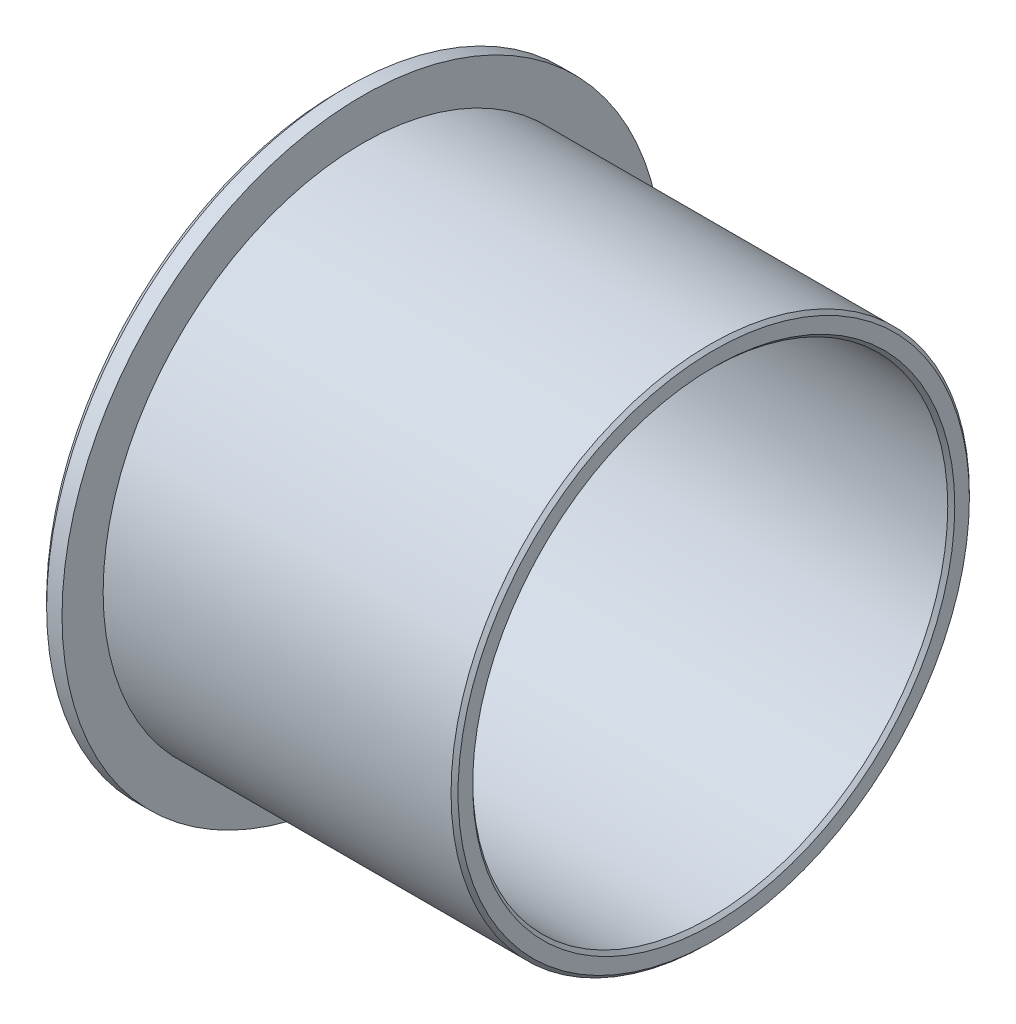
ISO-10303-21;
HEADER;
FILE_DESCRIPTION(('STEP AP214'),'2;1');
FILE_NAME('part.step','',(''),(''),'','','');
FILE_SCHEMA(('AUTOMOTIVE_DESIGN { 1 0 10303 214 1 1 1 1 }'));
ENDSEC;
DATA;
#1=APPLICATION_CONTEXT('core data for automotive mechanical design processes');
#2=APPLICATION_PROTOCOL_DEFINITION('international standard','automotive_design',2000,#1);
#3=PRODUCT_CONTEXT('',#1,'mechanical');
#4=PRODUCT('Part','Part','',(#3));
#5=PRODUCT_RELATED_PRODUCT_CATEGORY('part','',(#4));
#6=PRODUCT_DEFINITION_FORMATION('','',#4);
#7=PRODUCT_DEFINITION_CONTEXT('part definition',#1,'design');
#8=PRODUCT_DEFINITION('design','',#6,#7);
#9=PRODUCT_DEFINITION_SHAPE('','',#8);
#10=(LENGTH_UNIT() NAMED_UNIT(*) SI_UNIT(.MILLI.,.METRE.));
#11=(NAMED_UNIT(*) PLANE_ANGLE_UNIT() SI_UNIT($,.RADIAN.));
#12=(NAMED_UNIT(*) SI_UNIT($,.STERADIAN.) SOLID_ANGLE_UNIT());
#13=UNCERTAINTY_MEASURE_WITH_UNIT(LENGTH_MEASURE(1.E-05),#10,'distance_accuracy_value','');
#14=(GEOMETRIC_REPRESENTATION_CONTEXT(3) GLOBAL_UNCERTAINTY_ASSIGNED_CONTEXT((#13)) GLOBAL_UNIT_ASSIGNED_CONTEXT((#10,
#11,#12)) REPRESENTATION_CONTEXT('',''));
#15=CARTESIAN_POINT('',(0.,0.,0.));
#16=DIRECTION('',(0.,0.,1.));
#17=DIRECTION('',(1.,0.,0.));
#18=AXIS2_PLACEMENT_3D('',#15,#16,#17);
#19=CARTESIAN_POINT('',(0.,0.,0.));
#20=DIRECTION('',(1.,0.,0.));
#21=DIRECTION('',(0.,0.,-1.));
#22=AXIS2_PLACEMENT_3D('',#19,#20,#21);
#23=PLANE('',#22);
#24=CARTESIAN_POINT('',(0.,0.,0.));
#25=DIRECTION('',(1.,0.,0.));
#26=DIRECTION('',(0.,0.,-1.));
#27=AXIS2_PLACEMENT_3D('',#24,#25,#26);
#28=CIRCLE('',#27,27.320875);
#29=CARTESIAN_POINT('',(0.,0.,-27.320875));
#30=VERTEX_POINT('',#29);
#31=EDGE_CURVE('E10',#30,#30,#28,.T.);
#32=ORIENTED_EDGE('',*,*,#31,.T.);
#33=EDGE_LOOP('',(#32));
#34=FACE_BOUND('',#33,.T.);
#35=CARTESIAN_POINT('',(0.,0.,0.));
#36=DIRECTION('',(1.,0.,0.));
#37=DIRECTION('',(0.,0.,-1.));
#38=AXIS2_PLACEMENT_3D('',#35,#36,#37);
#39=CIRCLE('',#38,33.24225);
#40=CARTESIAN_POINT('',(0.,0.,-33.24225));
#41=VERTEX_POINT('',#40);
#42=EDGE_CURVE('E41',#41,#41,#39,.F.);
#43=ORIENTED_EDGE('',*,*,#42,.T.);
#44=EDGE_LOOP('',(#43));
#45=FACE_BOUND('',#44,.T.);
#46=ADVANCED_FACE('F15',(#34,#45),#23,.F.);
#47=CARTESIAN_POINT('',(42.3672,0.,0.));
#48=DIRECTION('',(1.,0.,0.));
#49=DIRECTION('',(0.,0.,-1.));
#50=AXIS2_PLACEMENT_3D('',#47,#48,#49);
#51=PLANE('',#50);
#52=CARTESIAN_POINT('',(42.3672,0.,0.));
#53=DIRECTION('',(1.,0.,0.));
#54=DIRECTION('',(0.,0.,-1.));
#55=AXIS2_PLACEMENT_3D('',#52,#53,#54);
#56=CIRCLE('',#55,27.320875);
#57=CARTESIAN_POINT('',(42.3672,0.,-27.320875));
#58=VERTEX_POINT('',#57);
#59=EDGE_CURVE('E26',#58,#58,#56,.F.);
#60=ORIENTED_EDGE('',*,*,#59,.T.);
#61=EDGE_LOOP('',(#60));
#62=FACE_BOUND('',#61,.T.);
#63=CARTESIAN_POINT('',(42.3672,0.,0.));
#64=DIRECTION('',(1.,0.,0.));
#65=DIRECTION('',(0.,0.,-1.));
#66=AXIS2_PLACEMENT_3D('',#63,#64,#65);
#67=CIRCLE('',#66,28.978225);
#68=CARTESIAN_POINT('',(42.3672,0.,-28.978225));
#69=VERTEX_POINT('',#68);
#70=EDGE_CURVE('E30',#69,#69,#67,.T.);
#71=ORIENTED_EDGE('',*,*,#70,.T.);
#72=EDGE_LOOP('',(#71));
#73=FACE_BOUND('',#72,.T.);
#74=ADVANCED_FACE('F73',(#62,#73),#51,.T.);
#75=CARTESIAN_POINT('',(2.54,0.,0.));
#76=DIRECTION('',(1.,0.,0.));
#77=DIRECTION('',(0.,0.,-1.));
#78=AXIS2_PLACEMENT_3D('',#75,#76,#77);
#79=PLANE('',#78);
#80=CARTESIAN_POINT('',(2.54,0.,0.));
#81=DIRECTION('',(1.,0.,0.));
#82=DIRECTION('',(0.,0.,-1.));
#83=AXIS2_PLACEMENT_3D('',#80,#81,#82);
#84=CIRCLE('',#83,34.036);
#85=CARTESIAN_POINT('',(2.54,0.,-34.036));
#86=VERTEX_POINT('',#85);
#87=EDGE_CURVE('E47',#86,#86,#84,.T.);
#88=ORIENTED_EDGE('',*,*,#87,.T.);
#89=EDGE_LOOP('',(#88));
#90=FACE_BOUND('',#89,.T.);
#91=CARTESIAN_POINT('',(2.54,0.,0.));
#92=DIRECTION('',(1.,0.,0.));
#93=DIRECTION('',(0.,0.,-1.));
#94=AXIS2_PLACEMENT_3D('',#91,#92,#93);
#95=CIRCLE('',#94,29.3751);
#96=CARTESIAN_POINT('',(2.54,0.,-29.3751));
#97=VERTEX_POINT('',#96);
#98=EDGE_CURVE('E50',#97,#97,#95,.F.);
#99=ORIENTED_EDGE('',*,*,#98,.T.);
#100=EDGE_LOOP('',(#99));
#101=FACE_BOUND('',#100,.T.);
#102=ADVANCED_FACE('F54',(#90,#101),#79,.T.);
#103=CARTESIAN_POINT('',(2.54,0.,0.));
#104=DIRECTION('',(-1.,0.,0.));
#105=DIRECTION('',(0.,0.,1.));
#106=AXIS2_PLACEMENT_3D('',#103,#104,#105);
#107=CYLINDRICAL_SURFACE('',#106,34.036);
#108=CARTESIAN_POINT('',(0.793750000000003,0.,0.));
#109=DIRECTION('',(1.,0.,0.));
#110=DIRECTION('',(0.,0.,-1.));
#111=AXIS2_PLACEMENT_3D('',#108,#109,#110);
#112=CIRCLE('',#111,34.036);
#113=CARTESIAN_POINT('',(0.793750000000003,0.,-34.036));
#114=VERTEX_POINT('',#113);
#115=EDGE_CURVE('E44',#114,#114,#112,.T.);
#116=ORIENTED_EDGE('',*,*,#115,.T.);
#117=EDGE_LOOP('',(#116));
#118=FACE_BOUND('',#117,.T.);
#119=ORIENTED_EDGE('',*,*,#87,.F.);
#120=EDGE_LOOP('',(#119));
#121=FACE_BOUND('',#120,.T.);
#122=ADVANCED_FACE('F17',(#118,#121),#107,.T.);
#123=CARTESIAN_POINT('',(42.3672,0.,0.));
#124=DIRECTION('',(-1.,0.,0.));
#125=DIRECTION('',(0.,0.,1.));
#126=AXIS2_PLACEMENT_3D('',#123,#124,#125);
#127=CYLINDRICAL_SURFACE('',#126,29.3751);
#128=CARTESIAN_POINT('',(41.970325,0.,0.));
#129=DIRECTION('',(1.,0.,0.));
#130=DIRECTION('',(0.,0.,-1.));
#131=AXIS2_PLACEMENT_3D('',#128,#129,#130);
#132=CIRCLE('',#131,29.3751);
#133=CARTESIAN_POINT('',(41.970325,0.,-29.3751));
#134=VERTEX_POINT('',#133);
#135=EDGE_CURVE('E22',#134,#134,#132,.F.);
#136=ORIENTED_EDGE('',*,*,#135,.T.);
#137=EDGE_LOOP('',(#136));
#138=FACE_BOUND('',#137,.T.);
#139=ORIENTED_EDGE('',*,*,#98,.F.);
#140=EDGE_LOOP('',(#139));
#141=FACE_BOUND('',#140,.T.);
#142=ADVANCED_FACE('F56',(#138,#141),#127,.T.);
#143=CARTESIAN_POINT('',(42.3672,0.,0.));
#144=DIRECTION('',(-1.,0.,0.));
#145=DIRECTION('',(0.,0.,1.));
#146=AXIS2_PLACEMENT_3D('',#143,#144,#145);
#147=CYLINDRICAL_SURFACE('',#146,26.924);
#148=CARTESIAN_POINT('',(41.970325,0.,0.));
#149=DIRECTION('',(1.,0.,0.));
#150=DIRECTION('',(0.,0.,-1.));
#151=AXIS2_PLACEMENT_3D('',#148,#149,#150);
#152=CIRCLE('',#151,26.924);
#153=CARTESIAN_POINT('',(41.970325,0.,-26.924));
#154=VERTEX_POINT('',#153);
#155=EDGE_CURVE('E35',#154,#154,#152,.T.);
#156=ORIENTED_EDGE('',*,*,#155,.T.);
#157=EDGE_LOOP('',(#156));
#158=FACE_BOUND('',#157,.T.);
#159=CARTESIAN_POINT('',(0.396875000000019,0.,0.));
#160=DIRECTION('',(1.,0.,0.));
#161=DIRECTION('',(0.,0.,-1.));
#162=AXIS2_PLACEMENT_3D('',#159,#160,#161);
#163=CIRCLE('',#162,26.924);
#164=CARTESIAN_POINT('',(0.396875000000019,0.,-26.924));
#165=VERTEX_POINT('',#164);
#166=EDGE_CURVE('E38',#165,#165,#163,.F.);
#167=ORIENTED_EDGE('',*,*,#166,.T.);
#168=EDGE_LOOP('',(#167));
#169=FACE_BOUND('',#168,.T.);
#170=ADVANCED_FACE('F58',(#158,#169),#147,.F.);
#171=CARTESIAN_POINT('',(0.793750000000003,0.,0.));
#172=DIRECTION('',(1.,0.,0.));
#173=DIRECTION('',(0.,0.,-1.));
#174=AXIS2_PLACEMENT_3D('',#171,#172,#173);
#175=CONICAL_SURFACE('',#174,34.036,0.785398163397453);
#176=CARTESIAN_POINT('',(0.,0.,-33.24225));
#177=CARTESIAN_POINT('',(0.00826822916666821,0.,-33.2505182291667));
#178=CARTESIAN_POINT('',(0.0165364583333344,0.,-33.2587864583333));
#179=CARTESIAN_POINT('',(0.0330729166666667,0.,-33.2753229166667));
#180=CARTESIAN_POINT('',(0.0413411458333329,0.,-33.2835911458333));
#181=CARTESIAN_POINT('',(0.0578776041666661,0.,-33.3001276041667));
#182=CARTESIAN_POINT('',(0.0661458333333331,0.,-33.3083958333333));
#183=CARTESIAN_POINT('',(0.0826822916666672,0.,-33.3249322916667));
#184=CARTESIAN_POINT('',(0.0909505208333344,0.,-33.3332005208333));
#185=CARTESIAN_POINT('',(0.107486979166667,0.,-33.3497369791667));
#186=CARTESIAN_POINT('',(0.115755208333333,0.,-33.3580052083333));
#187=CARTESIAN_POINT('',(0.132291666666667,0.,-33.3745416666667));
#188=CARTESIAN_POINT('',(0.140559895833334,0.,-33.3828098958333));
#189=CARTESIAN_POINT('',(0.157096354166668,0.,-33.3993463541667));
#190=CARTESIAN_POINT('',(0.165364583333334,0.,-33.4076145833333));
#191=CARTESIAN_POINT('',(0.181901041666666,0.,-33.4241510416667));
#192=CARTESIAN_POINT('',(0.190169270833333,0.,-33.4324192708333));
#193=CARTESIAN_POINT('',(0.206705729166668,0.,-33.4489557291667));
#194=CARTESIAN_POINT('',(0.214973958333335,0.,-33.4572239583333));
#195=CARTESIAN_POINT('',(0.231510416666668,0.,-33.4737604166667));
#196=CARTESIAN_POINT('',(0.239778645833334,0.,-33.4820286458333));
#197=CARTESIAN_POINT('',(0.256315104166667,0.,-33.4985651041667));
#198=CARTESIAN_POINT('',(0.264583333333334,0.,-33.5068333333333));
#199=CARTESIAN_POINT('',(0.281119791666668,0.,-33.5233697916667));
#200=CARTESIAN_POINT('',(0.289388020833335,0.,-33.5316380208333));
#201=CARTESIAN_POINT('',(0.305924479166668,0.,-33.5481744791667));
#202=CARTESIAN_POINT('',(0.314192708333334,0.,-33.5564427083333));
#203=CARTESIAN_POINT('',(0.330729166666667,0.,-33.5729791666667));
#204=CARTESIAN_POINT('',(0.338997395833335,0.,-33.5812473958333));
#205=CARTESIAN_POINT('',(0.355533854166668,0.,-33.5977838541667));
#206=CARTESIAN_POINT('',(0.363802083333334,0.,-33.6060520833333));
#207=CARTESIAN_POINT('',(0.380338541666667,0.,-33.6225885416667));
#208=CARTESIAN_POINT('',(0.388606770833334,0.,-33.6308567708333));
#209=CARTESIAN_POINT('',(0.405143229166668,0.,-33.6473932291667));
#210=CARTESIAN_POINT('',(0.413411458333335,0.,-33.6556614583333));
#211=CARTESIAN_POINT('',(0.429947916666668,0.,-33.6721979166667));
#212=CARTESIAN_POINT('',(0.438216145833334,0.,-33.6804661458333));
#213=CARTESIAN_POINT('',(0.454752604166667,0.,-33.6970026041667));
#214=CARTESIAN_POINT('',(0.463020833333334,0.,-33.7052708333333));
#215=CARTESIAN_POINT('',(0.479557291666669,0.,-33.7218072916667));
#216=CARTESIAN_POINT('',(0.487825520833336,0.,-33.7300755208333));
#217=CARTESIAN_POINT('',(0.504361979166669,0.,-33.7466119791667));
#218=CARTESIAN_POINT('',(0.512630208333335,0.,-33.7548802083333));
#219=CARTESIAN_POINT('',(0.529166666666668,0.,-33.7714166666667));
#220=CARTESIAN_POINT('',(0.537434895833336,0.,-33.7796848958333));
#221=CARTESIAN_POINT('',(0.553971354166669,0.,-33.7962213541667));
#222=CARTESIAN_POINT('',(0.562239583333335,0.,-33.8044895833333));
#223=CARTESIAN_POINT('',(0.578776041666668,0.,-33.8210260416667));
#224=CARTESIAN_POINT('',(0.587044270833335,0.,-33.8292942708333));
#225=CARTESIAN_POINT('',(0.603580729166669,0.,-33.8458307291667));
#226=CARTESIAN_POINT('',(0.611848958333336,0.,-33.8540989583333));
#227=CARTESIAN_POINT('',(0.628385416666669,0.,-33.8706354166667));
#228=CARTESIAN_POINT('',(0.636653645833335,0.,-33.8789036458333));
#229=CARTESIAN_POINT('',(0.653190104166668,0.,-33.8954401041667));
#230=CARTESIAN_POINT('',(0.661458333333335,0.,-33.9037083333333));
#231=CARTESIAN_POINT('',(0.677994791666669,0.,-33.9202447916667));
#232=CARTESIAN_POINT('',(0.686263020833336,0.,-33.9285130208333));
#233=CARTESIAN_POINT('',(0.702799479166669,0.,-33.9450494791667));
#234=CARTESIAN_POINT('',(0.711067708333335,0.,-33.9533177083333));
#235=CARTESIAN_POINT('',(0.727604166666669,0.,-33.9698541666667));
#236=CARTESIAN_POINT('',(0.735872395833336,0.,-33.9781223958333));
#237=CARTESIAN_POINT('',(0.75240885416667,0.,-33.9946588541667));
#238=CARTESIAN_POINT('',(0.760677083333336,0.,-34.0029270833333));
#239=CARTESIAN_POINT('',(0.777213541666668,0.,-34.0194635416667));
#240=CARTESIAN_POINT('',(0.785481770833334,0.,-34.0277317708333));
#241=CARTESIAN_POINT('',(0.793750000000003,0.,-34.036));
#242=B_SPLINE_CURVE_WITH_KNOTS('',3,(#176,#177,#178,#179,#180,#181,#182,#183,#184,#185,#186,
#187,#188,#189,#190,#191,#192,#193,#194,#195,#196,#197,#198,#199,#200,#201,#202,#203,#204,#205,
#206,#207,#208,#209,#210,#211,#212,#213,#214,#215,#216,#217,#218,#219,#220,#221,#222,#223,#224,
#225,#226,#227,#228,#229,#230,#231,#232,#233,#234,#235,#236,#237,#238,#239,#240,#241),
.UNSPECIFIED.,.F.,.F.,(4,2,2,2,2,2,2,2,2,2,2,2,2,2,2,2,2,2,2,2,2,2,2,2,2,2,2,2,2,2,2,2,4),(0.,
0.0350791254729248,0.0701582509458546,0.105237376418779,0.140316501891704,0.175395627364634,
0.210474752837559,0.245553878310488,0.280633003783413,0.315712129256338,0.350791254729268,
0.385870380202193,0.420949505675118,0.456028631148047,0.491107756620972,0.526186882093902,
0.561266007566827,0.596345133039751,0.631424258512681,0.666503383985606,0.701582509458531,
0.736661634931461,0.771740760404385,0.806819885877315,0.84189901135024,0.876978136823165,
0.912057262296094,0.947136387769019,0.982215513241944,1.01729463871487,1.0523737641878,
1.08745288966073,1.12253201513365),.UNSPECIFIED.);
#243=EDGE_CURVE('BSEAM66',#41,#114,#242,.T.);
#244=ORIENTED_EDGE('',*,*,#42,.F.);
#245=ORIENTED_EDGE('',*,*,#115,.F.);
#246=ORIENTED_EDGE('',*,*,#243,.T.);
#247=ORIENTED_EDGE('',*,*,#243,.F.);
#248=EDGE_LOOP('',(#244,#246,#245,#247));
#249=FACE_BOUND('',#248,.T.);
#250=ADVANCED_FACE('F66',(#249),#175,.T.);
#251=CARTESIAN_POINT('',(41.970325,0.,0.));
#252=DIRECTION('',(1.,0.,0.));
#253=DIRECTION('',(0.,0.,-1.));
#254=AXIS2_PLACEMENT_3D('',#251,#252,#253);
#255=CONICAL_SURFACE('',#254,26.924,0.785398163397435);
#256=ORIENTED_EDGE('',*,*,#59,.F.);
#257=EDGE_LOOP('',(#256));
#258=FACE_BOUND('',#257,.T.);
#259=ORIENTED_EDGE('',*,*,#155,.F.);
#260=EDGE_LOOP('',(#259));
#261=FACE_BOUND('',#260,.T.);
#262=ADVANCED_FACE('F118',(#258,#261),#255,.F.);
#263=CARTESIAN_POINT('',(42.3672,0.,0.));
#264=DIRECTION('',(-1.,0.,0.));
#265=DIRECTION('',(0.,0.,1.));
#266=AXIS2_PLACEMENT_3D('',#263,#264,#265);
#267=CONICAL_SURFACE('',#266,28.978225,0.785398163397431);
#268=ORIENTED_EDGE('',*,*,#135,.F.);
#269=EDGE_LOOP('',(#268));
#270=FACE_BOUND('',#269,.T.);
#271=ORIENTED_EDGE('',*,*,#70,.F.);
#272=EDGE_LOOP('',(#271));
#273=FACE_BOUND('',#272,.T.);
#274=ADVANCED_FACE('F128',(#270,#273),#267,.T.);
#275=CARTESIAN_POINT('',(0.,0.,0.));
#276=DIRECTION('',(-1.,0.,0.));
#277=DIRECTION('',(0.,0.,1.));
#278=AXIS2_PLACEMENT_3D('',#275,#276,#277);
#279=CONICAL_SURFACE('',#278,27.320875,0.785398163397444);
#280=ORIENTED_EDGE('',*,*,#166,.F.);
#281=EDGE_LOOP('',(#280));
#282=FACE_BOUND('',#281,.T.);
#283=ORIENTED_EDGE('',*,*,#31,.F.);
#284=EDGE_LOOP('',(#283));
#285=FACE_BOUND('',#284,.T.);
#286=ADVANCED_FACE('F138',(#282,#285),#279,.F.);
#287=CLOSED_SHELL('',(#46,#74,#102,#122,#142,#170,#250,#262,#274,#286));
#288=MANIFOLD_SOLID_BREP('B1',#287);
#289=ADVANCED_BREP_SHAPE_REPRESENTATION('',(#18,#288),#14);
#290=SHAPE_DEFINITION_REPRESENTATION(#9,#289);
ENDSEC;
END-ISO-10303-21;
